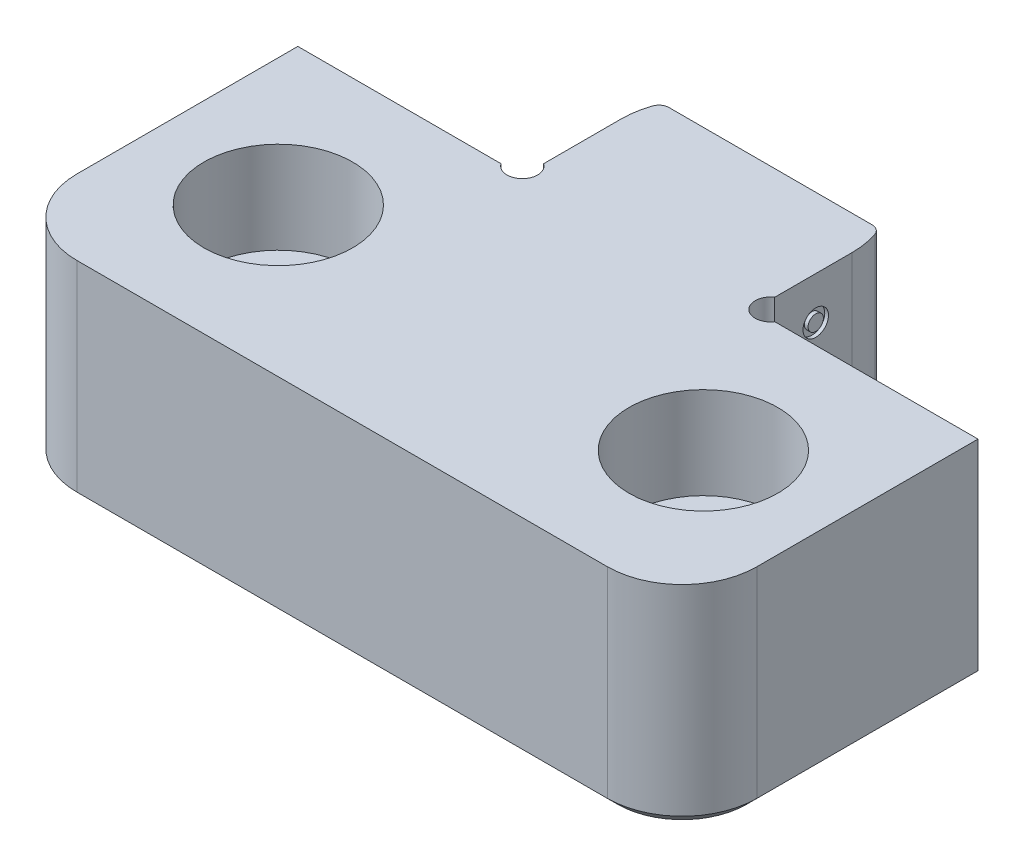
from build123d import *

# Parameters (mm, degrees)
BOSS_EXTRUDE1_DEPTH     = 15.748
SKETCH3_R               = 1.143
CUT_EXTRUDE2_DEPTH      = 38.16828094
FILLET1_R               = 5.588
CHAMFER1_SIZE           = 0.762
F_1_4_CBORE_D           = 7.1374
F_1_4_CBORE_CBORE_D     = 11.1125
F_1_4_CBORE_CBORE_DEPTH = 6.858
SKETCH8_R               = 0.9525
SKETCH8_R_2             = 0.5715
CUT_EXTRUDE3_DEPTH      = 0.2794
CUT_EXTRUDE4_DEPTH      = 44.526974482


with BuildPart() as part:
    # Sketch1 → Boss-Extrude1 (new body)
    with BuildSketch(Plane(origin=(0, 0, 0), x_dir=(1, 0, 0), z_dir=(0, 1, 0))):
        with BuildLine():
            Line((-25.4, -22.098), (25.4, -22.098))
            Line((25.4, -22.098), (25.4, 0))
            Line((25.4, 0), (8.63346, 0))
            Line((8.63346, 0), (8.63346, 7.366))
            ThreePointArc((8.63346, 7.366), (8.550414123, 8.389614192), (8.303448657, 9.386454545))
            ThreePointArc((8.303448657, 9.386454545), (8.025962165, 9.762625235), (7.581050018, 9.906))
            Line((7.581050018, 9.906), (-7.581050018, 9.906))
            ThreePointArc((-7.581050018, 9.906), (-8.025962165, 9.762625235), (-8.303448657, 9.386454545))
            ThreePointArc((-8.303448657, 9.386454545), (-8.550414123, 8.389614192), (-8.63346, 7.366))
            Line((-8.63346, 7.366), (-8.63346, 0))
            Line((-8.63346, 0), (-25.4, 0))
            Line((-25.4, 0), (-25.4, -22.098))
        make_face()
    extrude(amount=-BOSS_EXTRUDE1_DEPTH)

    # Sketch3 → Cut-Extrude2 (cut, through all)
    with BuildSketch(Plane(origin=(0, 0, 0), x_dir=(1, 0, 0), z_dir=(0, 1, 0))):
        with Locations((9.26846, 0.635)):
            Circle(SKETCH3_R)
        with Locations((-9.26846, 0.635)):
            Circle(SKETCH3_R)
    extrude(amount=-CUT_EXTRUDE2_DEPTH, mode=Mode.SUBTRACT)

    # Fillet1
    fillet1_edges = [part.edges().sort_by_distance(p)[0] for p in [
        (25.4, -7.874, 22.098),
        (-25.4, -7.874, 22.098),
    ]]
    fillet(fillet1_edges, radius=FILLET1_R)

    # Chamfer1
    chamfer1_edges = [part.edges().sort_by_distance(p)[0] for p in [
        (-25.4, -15.748, 8.255),
        (0, -15.748, 22.098),
        (25.4, -15.748, 8.255),
        (-23.763312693, -15.748, 20.461312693),
        (23.763312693, -15.748, 20.461312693),
    ]]
    chamfer(chamfer1_edges, length=CHAMFER1_SIZE)

    # 1_4_ CBORE (through all)
    with Locations(Plane(origin=(0, 0, 0), x_dir=(-1, 0, 0), z_dir=(0, 1, 0))):
        with Locations((15.875, 10.9855), (-15.875, 10.9855)):
            CounterBoreHole(F_1_4_CBORE_D / 2, F_1_4_CBORE_CBORE_D / 2, F_1_4_CBORE_CBORE_DEPTH)

    # Sketch8 → Cut-Extrude3 (cut)
    # profile 1 of 4: a face of its own
    with BuildSketch(Plane(origin=(8.63346, 0, 0), x_dir=(0, 0, -1), z_dir=(1, 0, 0))):
        with Locations((4.6482, -3.175)):
            Circle(SKETCH8_R)
        with Locations((4.6482, -3.175)):
            Circle(SKETCH8_R_2, mode=Mode.SUBTRACT)
    # profile 2 of 4: a face of its own
    with BuildSketch(Plane(origin=(8.63346, 0, 0), x_dir=(0, 0, -1), z_dir=(1, 0, 0))):
        with Locations((4.6482, -6.3246)):
            Circle(SKETCH8_R)
        with Locations((4.6482, -6.3246)):
            Circle(SKETCH8_R_2, mode=Mode.SUBTRACT)
    # profile 3 of 4: a face of its own
    with BuildSketch(Plane(origin=(8.63346, 0, 0), x_dir=(0, 0, -1), z_dir=(1, 0, 0))):
        with Locations((4.6482, -9.4996)):
            Circle(SKETCH8_R)
        with Locations((4.6482, -9.4996)):
            Circle(SKETCH8_R_2, mode=Mode.SUBTRACT)
    # profile 4 of 4: a face of its own
    with BuildSketch(Plane(origin=(8.63346, 0, 0), x_dir=(0, 0, -1), z_dir=(1, 0, 0))):
        with Locations((4.6482, -12.6746)):
            Circle(SKETCH8_R)
        with Locations((4.6482, -12.6746)):
            Circle(SKETCH8_R_2, mode=Mode.SUBTRACT)
    cut_extrude3 = extrude(amount=-CUT_EXTRUDE3_DEPTH, mode=Mode.SUBTRACT)

    # Mirror1: Cut-Extrude3 across plane
    add(cut_extrude3.mirror(Plane(origin=(0, 0, 0), x_dir=(0, 0, 1), z_dir=(1, 0, 0))), mode=Mode.SUBTRACT)

    # Sketch9 → Cut-Extrude4 (cut, through all)
    with BuildSketch(Plane(origin=(8.63346, 0, 0), x_dir=(0, 0, -1), z_dir=(1, 0, 0))):
        with BuildLine():
            Line((2.286, -15.748), (9.906, -15.748))
            Line((9.906, -15.748), (9.906, -15.289142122))
            ThreePointArc((9.906, -15.289142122), (6.102901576, -15.633181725), (2.286, -15.748))
        make_face()
    extrude(amount=-CUT_EXTRUDE4_DEPTH, mode=Mode.SUBTRACT)


solid = part.part
